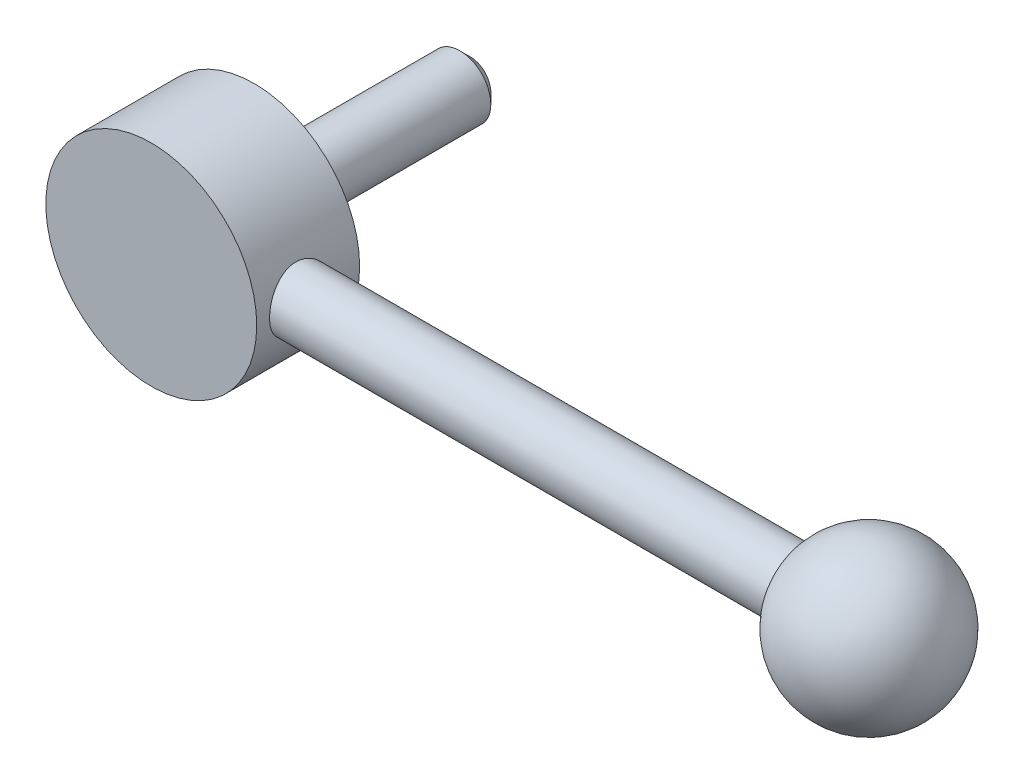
ISO-10303-21;
HEADER;
FILE_DESCRIPTION(('STEP AP214'),'2;1');
FILE_NAME('part.step','',(''),(''),'','','');
FILE_SCHEMA(('AUTOMOTIVE_DESIGN { 1 0 10303 214 1 1 1 1 }'));
ENDSEC;
DATA;
#1=APPLICATION_CONTEXT('core data for automotive mechanical design processes');
#2=APPLICATION_PROTOCOL_DEFINITION('international standard','automotive_design',2000,#1);
#3=PRODUCT_CONTEXT('',#1,'mechanical');
#4=PRODUCT('Part','Part','',(#3));
#5=PRODUCT_RELATED_PRODUCT_CATEGORY('part','',(#4));
#6=PRODUCT_DEFINITION_FORMATION('','',#4);
#7=PRODUCT_DEFINITION_CONTEXT('part definition',#1,'design');
#8=PRODUCT_DEFINITION('design','',#6,#7);
#9=PRODUCT_DEFINITION_SHAPE('','',#8);
#10=(LENGTH_UNIT() NAMED_UNIT(*) SI_UNIT(.MILLI.,.METRE.));
#11=(NAMED_UNIT(*) PLANE_ANGLE_UNIT() SI_UNIT($,.RADIAN.));
#12=(NAMED_UNIT(*) SI_UNIT($,.STERADIAN.) SOLID_ANGLE_UNIT());
#13=UNCERTAINTY_MEASURE_WITH_UNIT(LENGTH_MEASURE(1.E-05),#10,'distance_accuracy_value','');
#14=(GEOMETRIC_REPRESENTATION_CONTEXT(3) GLOBAL_UNCERTAINTY_ASSIGNED_CONTEXT((#13)) GLOBAL_UNIT_ASSIGNED_CONTEXT((#10,
#11,#12)) REPRESENTATION_CONTEXT('',''));
#15=CARTESIAN_POINT('',(0.,0.,0.));
#16=DIRECTION('',(0.,0.,1.));
#17=DIRECTION('',(1.,0.,0.));
#18=AXIS2_PLACEMENT_3D('',#15,#16,#17);
#19=CARTESIAN_POINT('',(0.,0.,40.));
#20=DIRECTION('',(0.,0.,1.));
#21=DIRECTION('',(1.,0.,0.));
#22=AXIS2_PLACEMENT_3D('',#19,#20,#21);
#23=CYLINDRICAL_SURFACE('',#22,9.5);
#24=CARTESIAN_POINT('',(0.,0.,2.));
#25=DIRECTION('',(0.,0.,1.));
#26=DIRECTION('',(1.,0.,0.));
#27=AXIS2_PLACEMENT_3D('',#24,#25,#26);
#28=CIRCLE('',#27,9.5);
#29=CARTESIAN_POINT('',(9.5,0.,2.));
#30=VERTEX_POINT('',#29);
#31=EDGE_CURVE('E37',#30,#30,#28,.T.);
#32=ORIENTED_EDGE('',*,*,#31,.F.);
#33=EDGE_LOOP('',(#32));
#34=FACE_BOUND('',#33,.T.);
#35=CARTESIAN_POINT('',(0.,0.,0.));
#36=DIRECTION('',(0.,0.,1.));
#37=DIRECTION('',(1.,0.,0.));
#38=AXIS2_PLACEMENT_3D('',#35,#36,#37);
#39=CIRCLE('',#38,9.5);
#40=CARTESIAN_POINT('',(9.5,0.,0.));
#41=VERTEX_POINT('',#40);
#42=EDGE_CURVE('E23',#41,#41,#39,.T.);
#43=ORIENTED_EDGE('',*,*,#42,.T.);
#44=EDGE_LOOP('',(#43));
#45=FACE_BOUND('',#44,.T.);
#46=ADVANCED_FACE('F12',(#34,#45),#23,.T.);
#47=CARTESIAN_POINT('',(6.,0.,0.));
#48=DIRECTION('',(0.,0.,1.));
#49=DIRECTION('',(1.,0.,0.));
#50=AXIS2_PLACEMENT_3D('',#47,#48,#49);
#51=PLANE('',#50);
#52=ORIENTED_EDGE('',*,*,#42,.F.);
#53=EDGE_LOOP('',(#52));
#54=FACE_BOUND('',#53,.T.);
#55=CARTESIAN_POINT('',(0.,0.,0.));
#56=DIRECTION('',(0.,0.,1.));
#57=DIRECTION('',(1.,0.,0.));
#58=AXIS2_PLACEMENT_3D('',#55,#56,#57);
#59=CIRCLE('',#58,6.);
#60=CARTESIAN_POINT('',(6.,0.,0.));
#61=VERTEX_POINT('',#60);
#62=EDGE_CURVE('E27',#61,#61,#59,.T.);
#63=ORIENTED_EDGE('',*,*,#62,.T.);
#64=EDGE_LOOP('',(#63));
#65=FACE_BOUND('',#64,.T.);
#66=ADVANCED_FACE('F63',(#54,#65),#51,.F.);
#67=CARTESIAN_POINT('',(0.,0.,40.));
#68=DIRECTION('',(0.,0.,1.));
#69=DIRECTION('',(1.,0.,0.));
#70=AXIS2_PLACEMENT_3D('',#67,#68,#69);
#71=CYLINDRICAL_SURFACE('',#70,6.);
#72=CARTESIAN_POINT('',(0.,0.,-38.));
#73=DIRECTION('',(0.,0.,-1.));
#74=DIRECTION('',(-1.,0.,0.));
#75=AXIS2_PLACEMENT_3D('',#72,#73,#74);
#76=CIRCLE('',#75,6.);
#77=CARTESIAN_POINT('',(-6.,0.,-38.));
#78=VERTEX_POINT('',#77);
#79=EDGE_CURVE('E19',#78,#78,#76,.F.);
#80=ORIENTED_EDGE('',*,*,#79,.T.);
#81=EDGE_LOOP('',(#80));
#82=FACE_BOUND('',#81,.T.);
#83=ORIENTED_EDGE('',*,*,#62,.F.);
#84=EDGE_LOOP('',(#83));
#85=FACE_BOUND('',#84,.T.);
#86=ADVANCED_FACE('F69',(#82,#85),#71,.T.);
#87=CARTESIAN_POINT('',(6.,0.,-40.));
#88=DIRECTION('',(0.,0.,-1.));
#89=DIRECTION('',(-1.,0.,0.));
#90=AXIS2_PLACEMENT_3D('',#87,#88,#89);
#91=PLANE('',#90);
#92=CARTESIAN_POINT('',(0.,0.,-40.));
#93=DIRECTION('',(0.,0.,-1.));
#94=DIRECTION('',(-1.,0.,0.));
#95=AXIS2_PLACEMENT_3D('',#92,#93,#94);
#96=CIRCLE('',#95,4.);
#97=CARTESIAN_POINT('',(-4.,0.,-40.));
#98=VERTEX_POINT('',#97);
#99=EDGE_CURVE('E8',#98,#98,#96,.T.);
#100=ORIENTED_EDGE('',*,*,#99,.T.);
#101=EDGE_LOOP('',(#100));
#102=FACE_BOUND('',#101,.T.);
#103=ADVANCED_FACE('F77',(#102),#91,.T.);
#104=CARTESIAN_POINT('',(20.5,0.,22.));
#105=DIRECTION('',(0.,0.,-1.));
#106=DIRECTION('',(-1.,0.,0.));
#107=AXIS2_PLACEMENT_3D('',#104,#105,#106);
#108=PLANE('',#107);
#109=CARTESIAN_POINT('',(0.,0.,22.));
#110=DIRECTION('',(0.,0.,1.));
#111=DIRECTION('',(1.,0.,0.));
#112=AXIS2_PLACEMENT_3D('',#109,#110,#111);
#113=CIRCLE('',#112,20.5);
#114=CARTESIAN_POINT('',(20.5,0.,22.));
#115=VERTEX_POINT('',#114);
#116=EDGE_CURVE('E86',#115,#115,#113,.T.);
#117=ORIENTED_EDGE('',*,*,#116,.T.);
#118=EDGE_LOOP('',(#117));
#119=FACE_BOUND('',#118,.T.);
#120=ADVANCED_FACE('F58',(#119),#108,.F.);
#121=CARTESIAN_POINT('',(0.,0.,40.));
#122=DIRECTION('',(0.,0.,1.));
#123=DIRECTION('',(1.,0.,0.));
#124=AXIS2_PLACEMENT_3D('',#121,#122,#123);
#125=CYLINDRICAL_SURFACE('',#124,20.5);
#126=CARTESIAN_POINT('',(20.5,0.,7.5));
#127=CARTESIAN_POINT('',(20.4999997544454,-0.164768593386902,7.50000038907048));
#128=CARTESIAN_POINT('',(20.4980087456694,-0.329544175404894,7.50679278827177));
#129=CARTESIAN_POINT('',(20.4900990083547,-0.65788822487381,7.5339021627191));
#130=CARTESIAN_POINT('',(20.4841800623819,-0.821456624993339,7.55421988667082));
#131=CARTESIAN_POINT('',(20.4685766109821,-1.1462122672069,7.60820100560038));
#132=CARTESIAN_POINT('',(20.4588916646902,-1.30739922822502,7.64186596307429));
#133=CARTESIAN_POINT('',(20.4360164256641,-1.62628314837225,7.72226244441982));
#134=CARTESIAN_POINT('',(20.4228249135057,-1.7839788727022,7.76899851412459));
#135=CARTESIAN_POINT('',(20.3933182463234,-2.09448185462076,7.87505403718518));
#136=CARTESIAN_POINT('',(20.3770082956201,-2.24729676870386,7.93435254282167));
#137=CARTESIAN_POINT('',(20.3416823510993,-2.54730770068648,8.06511256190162));
#138=CARTESIAN_POINT('',(20.3226662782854,-2.69450355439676,8.13657443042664));
#139=CARTESIAN_POINT('',(20.2824208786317,-2.98237032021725,8.2911456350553));
#140=CARTESIAN_POINT('',(20.2611910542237,-3.123039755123,8.37425759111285));
#141=CARTESIAN_POINT('',(20.2170775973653,-3.39691169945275,8.55150630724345));
#142=CARTESIAN_POINT('',(20.1941944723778,-3.53011647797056,8.6456396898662));
#143=CARTESIAN_POINT('',(20.146767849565,-3.79154794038,8.84682399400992));
#144=CARTESIAN_POINT('',(20.1221971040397,-3.91956600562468,8.95413966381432));
#145=CARTESIAN_POINT('',(20.0725990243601,-4.1661228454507,9.17897611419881));
#146=CARTESIAN_POINT('',(20.0475718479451,-4.2846648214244,9.29649342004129));
#147=CARTESIAN_POINT('',(19.9977175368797,-4.5116297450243,9.54108035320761));
#148=CARTESIAN_POINT('',(19.9728905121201,-4.62004743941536,9.66815487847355));
#149=CARTESIAN_POINT('',(19.9241410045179,-4.82595045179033,9.93095842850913));
#150=CARTESIAN_POINT('',(19.9002181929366,-4.92343976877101,10.0666842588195));
#151=CARTESIAN_POINT('',(19.8534354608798,-5.10885934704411,10.3490171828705));
#152=CARTESIAN_POINT('',(19.8306098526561,-5.19653638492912,10.4957964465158));
#153=CARTESIAN_POINT('',(19.7872868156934,-5.35913808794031,10.7965125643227));
#154=CARTESIAN_POINT('',(19.766788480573,-5.43406772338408,10.9504465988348));
#155=CARTESIAN_POINT('',(19.7287391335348,-5.57062666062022,11.2645036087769));
#156=CARTESIAN_POINT('',(19.7111887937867,-5.63225293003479,11.4246279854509));
#157=CARTESIAN_POINT('',(19.6796082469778,-5.74162541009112,11.7498143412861));
#158=CARTESIAN_POINT('',(19.6655765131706,-5.78937764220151,11.9148741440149));
#159=CARTESIAN_POINT('',(19.6418018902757,-5.86952471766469,12.2443484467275));
#160=CARTESIAN_POINT('',(19.6319555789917,-5.90229162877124,12.4086649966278));
#161=CARTESIAN_POINT('',(19.6163432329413,-5.95397424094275,12.7395899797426));
#162=CARTESIAN_POINT('',(19.6105755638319,-5.97289549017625,12.9061974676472));
#163=CARTESIAN_POINT('',(19.603301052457,-5.99672775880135,13.2405034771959));
#164=CARTESIAN_POINT('',(19.6017941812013,-6.00163887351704,13.4082019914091));
#165=CARTESIAN_POINT('',(19.6030905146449,-5.99740342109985,13.7434027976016));
#166=CARTESIAN_POINT('',(19.6058936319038,-5.98825713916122,13.9109050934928));
#167=CARTESIAN_POINT('',(19.6155486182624,-5.95655212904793,14.238688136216));
#168=CARTESIAN_POINT('',(19.6222578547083,-5.9344657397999,14.3990190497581));
#169=CARTESIAN_POINT('',(19.6394095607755,-5.87745500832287,14.7172343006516));
#170=CARTESIAN_POINT('',(19.649853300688,-5.84252629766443,14.8751177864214));
#171=CARTESIAN_POINT('',(19.6741615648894,-5.7601395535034,15.187257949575));
#172=CARTESIAN_POINT('',(19.688025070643,-5.71268525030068,15.3415156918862));
#173=CARTESIAN_POINT('',(19.7187796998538,-5.60560692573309,15.6454959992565));
#174=CARTESIAN_POINT('',(19.7356719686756,-5.5459782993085,15.7952168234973));
#175=CARTESIAN_POINT('',(19.7722410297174,-5.41416819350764,16.0910079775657));
#176=CARTESIAN_POINT('',(19.7919506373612,-5.34183608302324,16.2370072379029));
#177=CARTESIAN_POINT('',(19.8334359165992,-5.18568691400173,16.5224423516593));
#178=CARTESIAN_POINT('',(19.8552123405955,-5.10186566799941,16.6618757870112));
#179=CARTESIAN_POINT('',(19.9227548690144,-4.8340177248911,17.0689782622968));
#180=CARTESIAN_POINT('',(19.9707648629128,-4.63350124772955,17.3256854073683));
#181=CARTESIAN_POINT('',(20.0696162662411,-4.18511260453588,17.8126329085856));
#182=CARTESIAN_POINT('',(20.1204944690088,-3.93567819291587,18.0414205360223));
#183=CARTESIAN_POINT('',(20.2176813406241,-3.40132203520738,18.4542852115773));
#184=CARTESIAN_POINT('',(20.2639897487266,-3.11639826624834,18.63835970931));
#185=CARTESIAN_POINT('',(20.3472018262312,-2.51664006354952,18.9573414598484));
#186=CARTESIAN_POINT('',(20.3840462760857,-2.2016334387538,19.0919412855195));
#187=CARTESIAN_POINT('',(20.4437541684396,-1.55212614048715,19.3058343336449));
#188=CARTESIAN_POINT('',(20.4666213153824,-1.21763065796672,19.3851422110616));
#189=CARTESIAN_POINT('',(20.4952175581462,-0.550953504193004,19.4838192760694));
#190=CARTESIAN_POINT('',(20.5015074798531,-0.219085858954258,19.5051506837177));
#191=CARTESIAN_POINT('',(20.4978783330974,0.44350281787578,19.4927506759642));
#192=CARTESIAN_POINT('',(20.4879613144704,0.774223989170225,19.4590262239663));
#193=CARTESIAN_POINT('',(20.4533992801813,1.41781519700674,19.3390673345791));
#194=CARTESIAN_POINT('',(20.4290727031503,1.73091547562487,19.253967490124));
#195=CARTESIAN_POINT('',(20.3684901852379,2.33834273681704,19.0350155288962));
#196=CARTESIAN_POINT('',(20.3322328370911,2.63266749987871,18.901157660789));
#197=CARTESIAN_POINT('',(20.2505580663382,3.201467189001,18.585163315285));
#198=CARTESIAN_POINT('',(20.2049537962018,3.47535043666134,18.4020133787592));
#199=CARTESIAN_POINT('',(20.1098009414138,3.98926947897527,17.9937010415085));
#200=CARTESIAN_POINT('',(20.0602514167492,4.22929716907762,17.7685286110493));
#201=CARTESIAN_POINT('',(19.9860369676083,4.56311282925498,17.3996018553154));
#202=CARTESIAN_POINT('',(19.9608943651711,4.67160496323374,17.2689475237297));
#203=CARTESIAN_POINT('',(19.9116554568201,4.87720494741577,16.9988051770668));
#204=CARTESIAN_POINT('',(19.8875587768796,4.97431688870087,16.8593203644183));
#205=CARTESIAN_POINT('',(19.8411019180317,5.15650338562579,16.5723575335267));
#206=CARTESIAN_POINT('',(19.8187424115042,5.24157329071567,16.4248764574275));
#207=CARTESIAN_POINT('',(19.7764458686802,5.39896546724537,16.1230001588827));
#208=CARTESIAN_POINT('',(19.7565078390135,5.47129297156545,15.9686078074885));
#209=CARTESIAN_POINT('',(19.7197444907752,5.60234699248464,15.6546484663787));
#210=CARTESIAN_POINT('',(19.7029051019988,5.6611353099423,15.49510893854));
#211=CARTESIAN_POINT('',(19.6727610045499,5.76501533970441,15.1713718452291));
#212=CARTESIAN_POINT('',(19.6594548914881,5.81011249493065,15.0071761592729));
#213=CARTESIAN_POINT('',(19.6367999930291,5.88622676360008,14.675294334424));
#214=CARTESIAN_POINT('',(19.6274509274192,5.91724487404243,14.5076084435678));
#215=CARTESIAN_POINT('',(19.6130187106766,5.96490739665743,14.1700260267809));
#216=CARTESIAN_POINT('',(19.6079354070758,5.98155232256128,14.0001295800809));
#217=CARTESIAN_POINT('',(19.6023186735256,5.9999323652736,13.6662567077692));
#218=CARTESIAN_POINT('',(19.6016119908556,6.00223524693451,13.5023141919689));
#219=CARTESIAN_POINT('',(19.6043094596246,5.99341910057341,13.1747666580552));
#220=CARTESIAN_POINT('',(19.6077150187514,5.98229547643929,13.0111617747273));
#221=CARTESIAN_POINT('',(19.6185313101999,5.94672790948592,12.6856110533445));
#222=CARTESIAN_POINT('',(19.6259403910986,5.92228945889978,12.5236645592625));
#223=CARTESIAN_POINT('',(19.6445384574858,5.86030325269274,12.2024601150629));
#224=CARTESIAN_POINT('',(19.6557288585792,5.82275058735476,12.0432031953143));
#225=CARTESIAN_POINT('',(19.6814005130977,5.73537439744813,11.7303823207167));
#226=CARTESIAN_POINT('',(19.6958418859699,5.68569901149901,11.5767736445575));
#227=CARTESIAN_POINT('',(19.7276768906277,5.57423736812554,11.2742707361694));
#228=CARTESIAN_POINT('',(19.7450715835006,5.51244675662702,11.125378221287));
#229=CARTESIAN_POINT('',(19.782319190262,5.37724463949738,10.8333301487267));
#230=CARTESIAN_POINT('',(19.802171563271,5.30383568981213,10.6901733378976));
#231=CARTESIAN_POINT('',(19.8438063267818,5.14587421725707,10.4103722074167));
#232=CARTESIAN_POINT('',(19.8655894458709,5.061317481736,10.2737303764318));
#233=CARTESIAN_POINT('',(19.9112797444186,4.87853600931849,10.0032239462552));
#234=CARTESIAN_POINT('',(19.9352342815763,4.77994030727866,9.86961789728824));
#235=CARTESIAN_POINT('',(19.9839347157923,4.57206196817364,9.61107007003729));
#236=CARTESIAN_POINT('',(20.0086809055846,4.46277534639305,9.48613155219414));
#237=CARTESIAN_POINT('',(20.0582834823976,4.23425660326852,9.24575891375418));
#238=CARTESIAN_POINT('',(20.0831398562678,4.11502564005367,9.13032368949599));
#239=CARTESIAN_POINT('',(20.1323098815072,3.86730499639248,8.90963180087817));
#240=CARTESIAN_POINT('',(20.1566233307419,3.7388119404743,8.80437888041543));
#241=CARTESIAN_POINT('',(20.2046974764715,3.46977987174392,8.6020699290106));
#242=CARTESIAN_POINT('',(20.2284250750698,3.32900807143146,8.50531528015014));
#243=CARTESIAN_POINT('',(20.2739466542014,3.03949915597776,8.32403500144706));
#244=CARTESIAN_POINT('',(20.2957406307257,2.8907620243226,8.23950939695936));
#245=CARTESIAN_POINT('',(20.3367679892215,2.58639447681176,8.0833769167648));
#246=CARTESIAN_POINT('',(20.356002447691,2.43076699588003,8.01176460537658));
#247=CARTESIAN_POINT('',(20.3913677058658,2.11366097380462,7.88201306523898));
#248=CARTESIAN_POINT('',(20.4074988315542,1.95218304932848,7.82387242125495));
#249=CARTESIAN_POINT('',(20.4344672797,1.64423058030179,7.72771145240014));
#250=CARTESIAN_POINT('',(20.4457076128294,1.49828162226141,7.68811373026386));
#251=CARTESIAN_POINT('',(20.4651675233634,1.2036242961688,7.62002138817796));
#252=CARTESIAN_POINT('',(20.4733873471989,1.0549161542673,7.59152586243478));
#253=CARTESIAN_POINT('',(20.4866168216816,0.755624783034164,7.54584620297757));
#254=CARTESIAN_POINT('',(20.491626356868,0.605041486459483,7.52866247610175));
#255=CARTESIAN_POINT('',(20.49831762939,0.302973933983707,7.50574067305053));
#256=CARTESIAN_POINT('',(20.5000002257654,0.151489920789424,7.49999964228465));
#257=CARTESIAN_POINT('',(20.5,0.,7.5));
#258=B_SPLINE_CURVE_WITH_KNOTS('',3,(#126,#127,#128,#129,#130,#131,#132,#133,#134,#135,#136,
#137,#138,#139,#140,#141,#142,#143,#144,#145,#146,#147,#148,#149,#150,#151,#152,#153,#154,#155,
#156,#157,#158,#159,#160,#161,#162,#163,#164,#165,#166,#167,#168,#169,#170,#171,#172,#173,#174,
#175,#176,#177,#178,#179,#180,#181,#182,#183,#184,#185,#186,#187,#188,#189,#190,#191,#192,#193,
#194,#195,#196,#197,#198,#199,#200,#201,#202,#203,#204,#205,#206,#207,#208,#209,#210,#211,#212,
#213,#214,#215,#216,#217,#218,#219,#220,#221,#222,#223,#224,#225,#226,#227,#228,#229,#230,#231,
#232,#233,#234,#235,#236,#237,#238,#239,#240,#241,#242,#243,#244,#245,#246,#247,#248,#249,#250,
#251,#252,#253,#254,#255,#256,#257),.UNSPECIFIED.,.T.,.F.,(4,2,2,2,2,2,2,2,2,2,2,2,2,2,2,2,2,2,
2,2,2,2,2,2,2,2,2,2,2,2,2,2,2,2,2,2,2,2,2,2,2,2,2,2,2,2,2,2,2,2,2,2,2,2,2,2,2,2,2,2,2,2,2,2,2,
4),(0.,0.494166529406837,0.988360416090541,1.48261217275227,1.97703603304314,2.47064184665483,
2.96426207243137,3.45799348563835,3.95157399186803,4.45753270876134,4.96331976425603,
5.46936781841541,5.97523008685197,6.49206535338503,7.00869863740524,7.52544955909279,
8.04197586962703,8.54486934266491,9.04756118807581,9.55024961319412,10.0529278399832,
10.5383093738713,11.0238561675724,11.5092585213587,11.9948448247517,12.4866344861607,
12.9786038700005,13.9617709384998,14.9839152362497,16.006117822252,17.0345689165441,
18.062747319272,19.0556662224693,20.0484595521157,21.0200911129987,21.9918373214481,
22.9853318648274,23.97906383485,24.4935931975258,25.0079370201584,25.5224789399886,
26.0368090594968,26.5487427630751,27.0604726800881,27.5721663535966,28.0838417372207,
28.5751252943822,29.066577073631,29.5578262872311,30.0492596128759,30.5349645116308,
31.0208442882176,31.5066173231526,31.9925744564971,32.4953010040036,32.9982156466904,
33.5010718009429,34.0041121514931,34.5208552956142,35.0375995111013,35.5541256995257,
36.0705976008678,36.525077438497,36.9795201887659,37.4339792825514,37.8883210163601),.UNSPECIFIED.);
#259=CARTESIAN_POINT('',(20.5,0.,7.5));
#260=VERTEX_POINT('',#259);
#261=EDGE_CURVE('E30',#260,#260,#258,.T.);
#262=ORIENTED_EDGE('',*,*,#261,.T.);
#263=EDGE_LOOP('',(#262));
#264=FACE_BOUND('',#263,.T.);
#265=ORIENTED_EDGE('',*,*,#116,.F.);
#266=EDGE_LOOP('',(#265));
#267=FACE_BOUND('',#266,.T.);
#268=CARTESIAN_POINT('',(0.,0.,2.));
#269=DIRECTION('',(0.,0.,1.));
#270=DIRECTION('',(1.,0.,0.));
#271=AXIS2_PLACEMENT_3D('',#268,#269,#270);
#272=CIRCLE('',#271,20.5);
#273=CARTESIAN_POINT('',(20.5,0.,2.));
#274=VERTEX_POINT('',#273);
#275=EDGE_CURVE('E88',#274,#274,#272,.T.);
#276=ORIENTED_EDGE('',*,*,#275,.T.);
#277=EDGE_LOOP('',(#276));
#278=FACE_BOUND('',#277,.T.);
#279=ADVANCED_FACE('F40',(#264,#267,#278),#125,.T.);
#280=CARTESIAN_POINT('',(9.5,0.,2.));
#281=DIRECTION('',(0.,0.,1.));
#282=DIRECTION('',(1.,0.,0.));
#283=AXIS2_PLACEMENT_3D('',#280,#281,#282);
#284=PLANE('',#283);
#285=ORIENTED_EDGE('',*,*,#275,.F.);
#286=EDGE_LOOP('',(#285));
#287=FACE_BOUND('',#286,.T.);
#288=ORIENTED_EDGE('',*,*,#31,.T.);
#289=EDGE_LOOP('',(#288));
#290=FACE_BOUND('',#289,.T.);
#291=ADVANCED_FACE('F49',(#287,#290),#284,.F.);
#292=CARTESIAN_POINT('',(-30.,0.,13.5));
#293=DIRECTION('',(-1.,0.,0.));
#294=DIRECTION('',(0.,0.,1.));
#295=AXIS2_PLACEMENT_3D('',#292,#293,#294);
#296=CYLINDRICAL_SURFACE('',#295,6.);
#297=CARTESIAN_POINT('',(117.252272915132,0.,13.5));
#298=DIRECTION('',(-1.,0.,0.));
#299=DIRECTION('',(0.,0.,1.));
#300=AXIS2_PLACEMENT_3D('',#297,#298,#299);
#301=CIRCLE('',#300,6.);
#302=CARTESIAN_POINT('',(117.252272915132,0.,19.5));
#303=VERTEX_POINT('',#302);
#304=EDGE_CURVE('E38',#303,#303,#301,.T.);
#305=ORIENTED_EDGE('',*,*,#304,.T.);
#306=EDGE_LOOP('',(#305));
#307=FACE_BOUND('',#306,.T.);
#308=ORIENTED_EDGE('',*,*,#261,.F.);
#309=EDGE_LOOP('',(#308));
#310=FACE_BOUND('',#309,.T.);
#311=ADVANCED_FACE('F44',(#307,#310),#296,.T.);
#312=CARTESIAN_POINT('',(131.,0.,13.5));
#313=DIRECTION('',(0.,0.,1.));
#314=DIRECTION('',(1.,0.,0.));
#315=AXIS2_PLACEMENT_3D('',#312,#313,#314);
#316=SPHERICAL_SURFACE('',#315,15.);
#317=CARTESIAN_POINT('',(131.,0.,13.5));
#318=DIRECTION('',(-1.,0.,0.));
#319=DIRECTION('',(0.,0.,1.));
#320=AXIS2_PLACEMENT_3D('',#317,#318,#319);
#321=SPHERICAL_SURFACE('',#320,15.);
#322=ORIENTED_EDGE('',*,*,#304,.F.);
#323=EDGE_LOOP('',(#322));
#324=FACE_BOUND('',#323,.T.);
#325=ADVANCED_FACE('F48',(#324),#321,.T.);
#326=CARTESIAN_POINT('',(0.,0.,-38.));
#327=DIRECTION('',(0.,0.,1.));
#328=DIRECTION('',(1.,0.,0.));
#329=AXIS2_PLACEMENT_3D('',#326,#327,#328);
#330=CONICAL_SURFACE('',#329,6.,0.785398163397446);
#331=ORIENTED_EDGE('',*,*,#99,.F.);
#332=EDGE_LOOP('',(#331));
#333=FACE_BOUND('',#332,.T.);
#334=ORIENTED_EDGE('',*,*,#79,.F.);
#335=EDGE_LOOP('',(#334));
#336=FACE_BOUND('',#335,.T.);
#337=ADVANCED_FACE('F14',(#333,#336),#330,.T.);
#338=CLOSED_SHELL('',(#46,#66,#86,#103,#120,#279,#291,#311,#325,#337));
#339=MANIFOLD_SOLID_BREP('B1',#338);
#340=ADVANCED_BREP_SHAPE_REPRESENTATION('',(#18,#339),#14);
#341=SHAPE_DEFINITION_REPRESENTATION(#9,#340);
ENDSEC;
END-ISO-10303-21;
